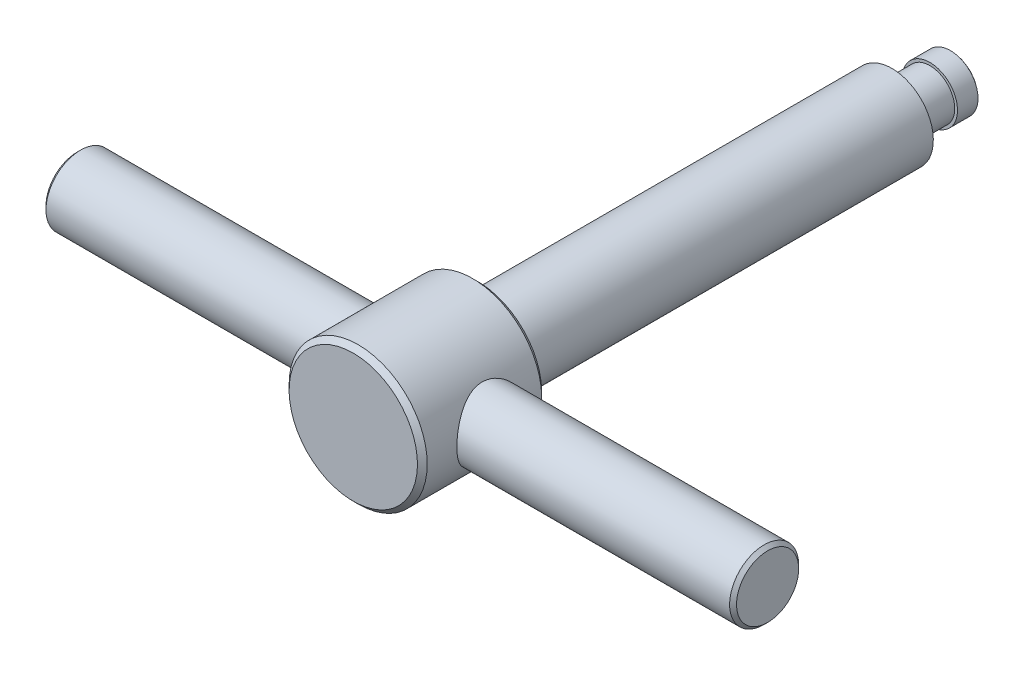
ISO-10303-21;
HEADER;
FILE_DESCRIPTION(('STEP AP214'),'2;1');
FILE_NAME('part.step','',(''),(''),'','','');
FILE_SCHEMA(('AUTOMOTIVE_DESIGN { 1 0 10303 214 1 1 1 1 }'));
ENDSEC;
DATA;
#1=APPLICATION_CONTEXT('core data for automotive mechanical design processes');
#2=APPLICATION_PROTOCOL_DEFINITION('international standard','automotive_design',2000,#1);
#3=PRODUCT_CONTEXT('',#1,'mechanical');
#4=PRODUCT('Part','Part','',(#3));
#5=PRODUCT_RELATED_PRODUCT_CATEGORY('part','',(#4));
#6=PRODUCT_DEFINITION_FORMATION('','',#4);
#7=PRODUCT_DEFINITION_CONTEXT('part definition',#1,'design');
#8=PRODUCT_DEFINITION('design','',#6,#7);
#9=PRODUCT_DEFINITION_SHAPE('','',#8);
#10=(LENGTH_UNIT() NAMED_UNIT(*) SI_UNIT(.MILLI.,.METRE.));
#11=(NAMED_UNIT(*) PLANE_ANGLE_UNIT() SI_UNIT($,.RADIAN.));
#12=(NAMED_UNIT(*) SI_UNIT($,.STERADIAN.) SOLID_ANGLE_UNIT());
#13=UNCERTAINTY_MEASURE_WITH_UNIT(LENGTH_MEASURE(1.E-05),#10,'distance_accuracy_value','');
#14=(GEOMETRIC_REPRESENTATION_CONTEXT(3) GLOBAL_UNCERTAINTY_ASSIGNED_CONTEXT((#13)) GLOBAL_UNIT_ASSIGNED_CONTEXT((#10,
#11,#12)) REPRESENTATION_CONTEXT('',''));
#15=CARTESIAN_POINT('',(0.,0.,0.));
#16=DIRECTION('',(0.,0.,1.));
#17=DIRECTION('',(1.,0.,0.));
#18=AXIS2_PLACEMENT_3D('',#15,#16,#17);
#19=CARTESIAN_POINT('',(50.,0.,82.5));
#20=DIRECTION('',(-1.,0.,0.));
#21=DIRECTION('',(0.,-1.,0.));
#22=AXIS2_PLACEMENT_3D('',#19,#20,#21);
#23=PLANE('',#22);
#24=CARTESIAN_POINT('',(50.0000000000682,0.,78.));
#25=DIRECTION('',(-1.,0.,0.));
#26=DIRECTION('',(0.,0.,-1.));
#27=AXIS2_PLACEMENT_3D('',#24,#25,#26);
#28=CIRCLE('',#27,4.49999999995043);
#29=CARTESIAN_POINT('',(50.0000000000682,0.,73.5000000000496));
#30=VERTEX_POINT('',#29);
#31=EDGE_CURVE('E15',#30,#30,#28,.T.);
#32=ORIENTED_EDGE('',*,*,#31,.F.);
#33=EDGE_LOOP('',(#32));
#34=FACE_BOUND('',#33,.T.);
#35=ADVANCED_FACE('F12',(#34),#23,.F.);
#36=CARTESIAN_POINT('',(-50.,0.,78.));
#37=DIRECTION('',(1.,0.,0.));
#38=DIRECTION('',(0.,1.,0.));
#39=AXIS2_PLACEMENT_3D('',#36,#37,#38);
#40=PLANE('',#39);
#41=CARTESIAN_POINT('',(-50.0000000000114,0.,78.));
#42=DIRECTION('',(1.,0.,0.));
#43=DIRECTION('',(0.,1.,0.));
#44=AXIS2_PLACEMENT_3D('',#41,#42,#43);
#45=CIRCLE('',#44,4.50000000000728);
#46=CARTESIAN_POINT('',(-50.0000000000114,4.50000000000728,78.));
#47=VERTEX_POINT('',#46);
#48=EDGE_CURVE('E133',#47,#47,#45,.T.);
#49=ORIENTED_EDGE('',*,*,#48,.F.);
#50=EDGE_LOOP('',(#49));
#51=FACE_BOUND('',#50,.T.);
#52=ADVANCED_FACE('F171',(#51),#40,.F.);
#53=CARTESIAN_POINT('',(0.,0.,6.));
#54=DIRECTION('',(-1.,0.,0.));
#55=DIRECTION('',(0.,1.,0.));
#56=AXIS2_PLACEMENT_3D('',#53,#54,#55);
#57=SPHERICAL_SURFACE('',#56,6.);
#58=CARTESIAN_POINT('',(0.,0.,1.52786404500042));
#59=DIRECTION('',(0.,0.,1.));
#60=DIRECTION('',(0.,-1.,0.));
#61=AXIS2_PLACEMENT_3D('',#58,#59,#60);
#62=CIRCLE('',#61,4.);
#63=CARTESIAN_POINT('',(0.,-4.,1.52786404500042));
#64=VERTEX_POINT('',#63);
#65=EDGE_CURVE('E126',#64,#64,#62,.T.);
#66=ORIENTED_EDGE('',*,*,#65,.F.);
#67=EDGE_LOOP('',(#66));
#68=FACE_BOUND('',#67,.T.);
#69=ADVANCED_FACE('F168',(#68),#57,.T.);
#70=CARTESIAN_POINT('',(49.5000000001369,0.,78.));
#71=DIRECTION('',(-1.,0.,0.));
#72=DIRECTION('',(0.,0.,-1.));
#73=AXIS2_PLACEMENT_3D('',#70,#71,#72);
#74=CONICAL_SURFACE('',#73,4.99999999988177,0.785398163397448);
#75=CARTESIAN_POINT('',(49.5,0.,78.));
#76=DIRECTION('',(-1.,0.,0.));
#77=DIRECTION('',(0.,-1.,0.));
#78=AXIS2_PLACEMENT_3D('',#75,#76,#77);
#79=CIRCLE('',#78,5.);
#80=CARTESIAN_POINT('',(49.5,-5.,78.));
#81=VERTEX_POINT('',#80);
#82=EDGE_CURVE('E124',#81,#81,#79,.T.);
#83=ORIENTED_EDGE('',*,*,#82,.F.);
#84=EDGE_LOOP('',(#83));
#85=FACE_BOUND('',#84,.T.);
#86=ORIENTED_EDGE('',*,*,#31,.T.);
#87=EDGE_LOOP('',(#86));
#88=FACE_BOUND('',#87,.T.);
#89=ADVANCED_FACE('F164',(#85,#88),#74,.T.);
#90=CARTESIAN_POINT('',(0.,0.,88.));
#91=DIRECTION('',(0.,0.,-1.));
#92=DIRECTION('',(0.,1.,0.));
#93=AXIS2_PLACEMENT_3D('',#90,#91,#92);
#94=PLANE('',#93);
#95=CARTESIAN_POINT('',(0.,0.,88.));
#96=DIRECTION('',(0.,0.,-1.));
#97=DIRECTION('',(0.,1.,0.));
#98=AXIS2_PLACEMENT_3D('',#95,#96,#97);
#99=CIRCLE('',#98,9.29289321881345);
#100=CARTESIAN_POINT('',(0.,9.29289321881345,88.));
#101=VERTEX_POINT('',#100);
#102=EDGE_CURVE('E121',#101,#101,#99,.T.);
#103=ORIENTED_EDGE('',*,*,#102,.F.);
#104=EDGE_LOOP('',(#103));
#105=FACE_BOUND('',#104,.T.);
#106=ADVANCED_FACE('F160',(#105),#94,.F.);
#107=CARTESIAN_POINT('',(-49.5000000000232,0.,78.));
#108=DIRECTION('',(1.,0.,0.));
#109=DIRECTION('',(0.,1.,0.));
#110=AXIS2_PLACEMENT_3D('',#107,#108,#109);
#111=CONICAL_SURFACE('',#110,4.99999999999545,0.785398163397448);
#112=ORIENTED_EDGE('',*,*,#48,.T.);
#113=EDGE_LOOP('',(#112));
#114=FACE_BOUND('',#113,.T.);
#115=CARTESIAN_POINT('',(-49.5,0.,78.));
#116=DIRECTION('',(-1.,0.,0.));
#117=DIRECTION('',(0.,-1.,0.));
#118=AXIS2_PLACEMENT_3D('',#115,#116,#117);
#119=CIRCLE('',#118,5.);
#120=CARTESIAN_POINT('',(-49.5,-5.,78.));
#121=VERTEX_POINT('',#120);
#122=EDGE_CURVE('E117',#121,#121,#119,.F.);
#123=ORIENTED_EDGE('',*,*,#122,.F.);
#124=EDGE_LOOP('',(#123));
#125=FACE_BOUND('',#124,.T.);
#126=ADVANCED_FACE('F154',(#114,#125),#111,.T.);
#127=CARTESIAN_POINT('',(0.,0.,0.));
#128=DIRECTION('',(0.,0.,1.));
#129=DIRECTION('',(0.,-1.,0.));
#130=AXIS2_PLACEMENT_3D('',#127,#128,#129);
#131=CYLINDRICAL_SURFACE('',#130,4.);
#132=CARTESIAN_POINT('',(0.,0.,4.5));
#133=DIRECTION('',(0.,0.,1.));
#134=DIRECTION('',(0.,-1.,0.));
#135=AXIS2_PLACEMENT_3D('',#132,#133,#134);
#136=CIRCLE('',#135,4.);
#137=CARTESIAN_POINT('',(0.,-4.,4.5));
#138=VERTEX_POINT('',#137);
#139=EDGE_CURVE('E120',#138,#138,#136,.F.);
#140=ORIENTED_EDGE('',*,*,#139,.T.);
#141=EDGE_LOOP('',(#140));
#142=FACE_BOUND('',#141,.T.);
#143=ORIENTED_EDGE('',*,*,#65,.T.);
#144=EDGE_LOOP('',(#143));
#145=FACE_BOUND('',#144,.T.);
#146=ADVANCED_FACE('F147',(#142,#145),#131,.T.);
#147=CARTESIAN_POINT('',(50.,0.,78.));
#148=DIRECTION('',(-1.,0.,0.));
#149=DIRECTION('',(0.,-1.,0.));
#150=AXIS2_PLACEMENT_3D('',#147,#148,#149);
#151=CYLINDRICAL_SURFACE('',#150,5.);
#152=CARTESIAN_POINT('',(8.6639413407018,4.99360795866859,77.7472559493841));
#153=CARTESIAN_POINT('',(8.6678034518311,4.98690821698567,77.6149033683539));
#154=CARTESIAN_POINT('',(8.67469455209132,4.97494418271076,77.4828866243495));
#155=CARTESIAN_POINT('',(8.69427133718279,4.94065080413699,77.2205887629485));
#156=CARTESIAN_POINT('',(8.70696013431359,4.91831589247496,77.0903086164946));
#157=CARTESIAN_POINT('',(8.73768503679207,4.86352211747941,76.8322782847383));
#158=CARTESIAN_POINT('',(8.75573112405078,4.83104434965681,76.7045333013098));
#159=CARTESIAN_POINT('',(8.79651985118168,4.75636852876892,76.4526662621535));
#160=CARTESIAN_POINT('',(8.81926458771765,4.71416613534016,76.3285458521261));
#161=CARTESIAN_POINT('',(8.89313906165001,4.57418822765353,75.964300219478));
#162=CARTESIAN_POINT('',(8.95014013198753,4.46265322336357,75.7304943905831));
#163=CARTESIAN_POINT('',(9.0733709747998,4.20643250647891,75.2848338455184));
#164=CARTESIAN_POINT('',(9.13960025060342,4.0617485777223,75.0729779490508));
#165=CARTESIAN_POINT('',(9.28089281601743,3.72835184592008,74.6568680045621));
#166=CARTESIAN_POINT('',(9.35622221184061,3.53689559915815,74.4548979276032));
#167=CARTESIAN_POINT('',(9.50269094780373,3.12203782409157,74.0846325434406));
#168=CARTESIAN_POINT('',(9.57382865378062,2.89862395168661,73.9163503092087));
#169=CARTESIAN_POINT('',(9.67330415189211,2.53843331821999,73.6898233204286));
#170=CARTESIAN_POINT('',(9.70581228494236,2.41146244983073,73.6174994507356));
#171=CARTESIAN_POINT('',(9.76685013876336,2.15092926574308,73.4839286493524));
#172=CARTESIAN_POINT('',(9.79538157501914,2.01736982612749,73.4226769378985));
#173=CARTESIAN_POINT('',(9.84761864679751,1.74461665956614,73.3119327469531));
#174=CARTESIAN_POINT('',(9.87132625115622,1.60542525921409,73.2624354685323));
#175=CARTESIAN_POINT('',(9.91320308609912,1.32244067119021,73.1757863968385));
#176=CARTESIAN_POINT('',(9.93137296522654,1.17864802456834,73.138633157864));
#177=CARTESIAN_POINT('',(9.96027993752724,0.900367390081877,73.0798607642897));
#178=CARTESIAN_POINT('',(9.97152591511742,0.766157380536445,73.0571718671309));
#179=CARTESIAN_POINT('',(9.98860845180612,0.495997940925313,73.022799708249));
#180=CARTESIAN_POINT('',(9.99444546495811,0.360048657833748,73.0111155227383));
#181=CARTESIAN_POINT('',(10.0005447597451,0.087573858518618,72.9989077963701));
#182=CARTESIAN_POINT('',(10.0008090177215,-0.04895143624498,72.9983802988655));
#183=CARTESIAN_POINT('',(9.99576016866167,-0.321481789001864,73.0084830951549));
#184=CARTESIAN_POINT('',(9.99044726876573,-0.457486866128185,73.0191129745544));
#185=CARTESIAN_POINT('',(9.97498362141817,-0.717956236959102,73.0502056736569));
#186=CARTESIAN_POINT('',(9.96521520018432,-0.842536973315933,73.0698923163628));
#187=CARTESIAN_POINT('',(9.94124846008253,-1.08948387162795,73.1185178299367));
#188=CARTESIAN_POINT('',(9.92704873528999,-1.21184931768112,73.1474596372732));
#189=CARTESIAN_POINT('',(9.89455126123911,-1.45351624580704,73.2142922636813));
#190=CARTESIAN_POINT('',(9.87625470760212,-1.57281861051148,73.2521804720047));
#191=CARTESIAN_POINT('',(9.83597398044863,-1.80771983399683,73.3365518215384));
#192=CARTESIAN_POINT('',(9.81398839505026,-1.92331725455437,73.3830382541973));
#193=CARTESIAN_POINT('',(9.74156802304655,-2.27136199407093,73.5382972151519));
#194=CARTESIAN_POINT('',(9.68581324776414,-2.49684688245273,73.6605947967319));
#195=CARTESIAN_POINT('',(9.56530778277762,-2.92480777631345,73.9366877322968));
#196=CARTESIAN_POINT('',(9.50055298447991,-3.12727319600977,74.0904974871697));
#197=CARTESIAN_POINT('',(9.36078921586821,-3.52480596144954,74.4428786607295));
#198=CARTESIAN_POINT('',(9.2854000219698,-3.71715140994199,74.6443755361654));
#199=CARTESIAN_POINT('',(9.1378260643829,-4.06646861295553,75.0774671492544));
#200=CARTESIAN_POINT('',(9.06564336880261,-4.22341779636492,75.3090809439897));
#201=CARTESIAN_POINT('',(8.96466251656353,-4.4318323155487,75.68047576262));
#202=CARTESIAN_POINT('',(8.93163700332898,-4.49782747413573,75.8111425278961));
#203=CARTESIAN_POINT('',(8.86988749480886,-4.618406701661,76.0785929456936));
#204=CARTESIAN_POINT('',(8.84116149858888,-4.67299608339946,76.2153737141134));
#205=CARTESIAN_POINT('',(8.78915478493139,-4.77009386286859,76.4940256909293));
#206=CARTESIAN_POINT('',(8.76586925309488,-4.81261294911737,76.6358922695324));
#207=CARTESIAN_POINT('',(8.72571734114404,-4.88503616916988,76.9236976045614));
#208=CARTESIAN_POINT('',(8.7088499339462,-4.91494232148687,77.0696357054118));
#209=CARTESIAN_POINT('',(8.68367597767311,-4.95926907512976,77.3491683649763));
#210=CARTESIAN_POINT('',(8.67467052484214,-4.9749602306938,77.4824995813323));
#211=CARTESIAN_POINT('',(8.66282228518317,-4.99556348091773,77.7502606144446));
#212=CARTESIAN_POINT('',(8.65997890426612,-5.00047661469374,77.88469032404));
#213=CARTESIAN_POINT('',(8.66057117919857,-4.99945062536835,78.1534566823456));
#214=CARTESIAN_POINT('',(8.66400516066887,-4.99351439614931,78.2877933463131));
#215=CARTESIAN_POINT('',(8.67700761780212,-4.97088602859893,78.5552512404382));
#216=CARTESIAN_POINT('',(8.68657590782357,-4.95419421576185,78.6883725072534));
#217=CARTESIAN_POINT('',(8.71036385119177,-4.91223841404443,78.940629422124));
#218=CARTESIAN_POINT('',(8.72409695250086,-4.88786373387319,79.0599602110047));
#219=CARTESIAN_POINT('',(8.75590671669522,-4.83064807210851,79.2959957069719));
#220=CARTESIAN_POINT('',(8.77398472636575,-4.79780446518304,79.4126995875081));
#221=CARTESIAN_POINT('',(8.83395755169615,-4.68703534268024,79.7578390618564));
#222=CARTESIAN_POINT('',(8.88160721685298,-4.59684472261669,79.9814608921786));
#223=CARTESIAN_POINT('',(8.99125967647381,-4.3787162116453,80.4275802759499));
#224=CARTESIAN_POINT('',(9.05407323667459,-4.2484468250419,80.6487244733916));
#225=CARTESIAN_POINT('',(9.18532801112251,-3.95668828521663,81.0675468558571));
#226=CARTESIAN_POINT('',(9.25377257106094,-3.79518049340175,81.265210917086));
#227=CARTESIAN_POINT('',(9.39832077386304,-3.42284387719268,81.6558446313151));
#228=CARTESIAN_POINT('',(9.47436862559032,-3.20843552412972,81.8454686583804));
#229=CARTESIAN_POINT('',(9.58193181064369,-2.8637698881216,82.1011420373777));
#230=CARTESIAN_POINT('',(9.61672131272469,-2.744956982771,82.1816143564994));
#231=CARTESIAN_POINT('',(9.68322432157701,-2.50024068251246,82.3323683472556));
#232=CARTESIAN_POINT('',(9.71493926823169,-2.37434065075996,82.402654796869));
#233=CARTESIAN_POINT('',(9.77437128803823,-2.11640250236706,82.5322892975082));
#234=CARTESIAN_POINT('',(9.80209494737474,-1.98437498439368,82.5916554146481));
#235=CARTESIAN_POINT('',(9.85280649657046,-1.71492890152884,82.698939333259));
#236=CARTESIAN_POINT('',(9.87579659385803,-1.57751288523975,82.7468624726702));
#237=CARTESIAN_POINT('',(9.91635831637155,-1.2983529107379,82.8306839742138));
#238=CARTESIAN_POINT('',(9.93393271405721,-1.15661120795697,82.8665884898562));
#239=CARTESIAN_POINT('',(9.96312961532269,-0.869940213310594,82.9259131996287));
#240=CARTESIAN_POINT('',(9.97475279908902,-0.725011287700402,82.949334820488));
#241=CARTESIAN_POINT('',(9.99083813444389,-0.447757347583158,82.9816683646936));
#242=CARTESIAN_POINT('',(9.99589570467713,-0.315606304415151,82.9917879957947));
#243=CARTESIAN_POINT('',(10.0007472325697,-0.0508240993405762,83.0014961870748));
#244=CARTESIAN_POINT('',(10.000541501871,0.0818070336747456,83.0010853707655));
#245=CARTESIAN_POINT('',(9.9948722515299,0.346478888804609,82.9897389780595));
#246=CARTESIAN_POINT('',(9.98940968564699,0.478519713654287,82.9788053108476));
#247=CARTESIAN_POINT('',(9.9733744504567,0.741008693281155,82.9465536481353));
#248=CARTESIAN_POINT('',(9.96280181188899,0.871456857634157,82.9252357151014));
#249=CARTESIAN_POINT('',(9.93743452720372,1.12369515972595,82.8737135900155));
#250=CARTESIAN_POINT('',(9.92286271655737,1.24560333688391,82.8439763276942));
#251=CARTESIAN_POINT('',(9.88966974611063,1.48634787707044,82.775610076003));
#252=CARTESIAN_POINT('',(9.87104728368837,1.60518323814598,82.7369782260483));
#253=CARTESIAN_POINT('',(9.80970869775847,1.95595951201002,82.6082690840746));
#254=CARTESIAN_POINT('',(9.76150048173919,2.1823686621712,82.5053371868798));
#255=CARTESIAN_POINT('',(9.65124513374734,2.62860908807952,82.2613458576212));
#256=CARTESIAN_POINT('',(9.58853528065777,2.84720551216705,82.1183503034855));
#257=CARTESIAN_POINT('',(9.45668808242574,3.25848585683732,81.8012792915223));
#258=CARTESIAN_POINT('',(9.38754708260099,3.45115488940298,81.6271861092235));
#259=CARTESIAN_POINT('',(9.24208671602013,3.82463320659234,81.2331021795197));
#260=CARTESIAN_POINT('',(9.16572457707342,4.00245580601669,81.0102916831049));
#261=CARTESIAN_POINT('',(9.02097056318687,4.31884937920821,80.5355067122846));
#262=CARTESIAN_POINT('',(8.95258327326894,4.4573978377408,80.2835156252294));
#263=CARTESIAN_POINT('',(8.86265475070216,4.63224192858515,79.8876796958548));
#264=CARTESIAN_POINT('',(8.83473366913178,4.68511709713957,79.752400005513));
#265=CARTESIAN_POINT('',(8.78424027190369,4.77911859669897,79.4768789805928));
#266=CARTESIAN_POINT('',(8.76166504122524,4.82025133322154,79.3366403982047));
#267=CARTESIAN_POINT('',(8.72286222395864,4.89011973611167,79.0526469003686));
#268=CARTESIAN_POINT('',(8.70661815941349,4.91888760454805,78.9089021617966));
#269=CARTESIAN_POINT('',(8.68114164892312,4.96371371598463,78.6189038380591));
#270=CARTESIAN_POINT('',(8.67190422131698,4.97978098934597,78.4726521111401));
#271=CARTESIAN_POINT('',(8.66276238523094,4.99565691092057,78.2296234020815));
#272=CARTESIAN_POINT('',(8.66073972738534,4.99915860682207,78.1331479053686));
#273=CARTESIAN_POINT('',(8.65992340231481,5.00057282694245,77.9401409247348));
#274=CARTESIAN_POINT('',(8.66112970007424,4.99848541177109,77.8436094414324));
#275=CARTESIAN_POINT('',(8.6639413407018,4.99360795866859,77.7472559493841));
#276=B_SPLINE_CURVE_WITH_KNOTS('',3,(#152,#153,#154,#155,#156,#157,#158,#159,#160,#161,#162,
#163,#164,#165,#166,#167,#168,#169,#170,#171,#172,#173,#174,#175,#176,#177,#178,#179,#180,#181,
#182,#183,#184,#185,#186,#187,#188,#189,#190,#191,#192,#193,#194,#195,#196,#197,#198,#199,#200,
#201,#202,#203,#204,#205,#206,#207,#208,#209,#210,#211,#212,#213,#214,#215,#216,#217,#218,#219,
#220,#221,#222,#223,#224,#225,#226,#227,#228,#229,#230,#231,#232,#233,#234,#235,#236,#237,#238,
#239,#240,#241,#242,#243,#244,#245,#246,#247,#248,#249,#250,#251,#252,#253,#254,#255,#256,#257,
#258,#259,#260,#261,#262,#263,#264,#265,#266,#267,#268,#269,#270,#271,#272,#273,#274,#275),
.UNSPECIFIED.,.T.,.F.,(4,2,2,2,2,2,2,2,2,2,2,2,2,2,2,2,2,2,2,2,2,2,2,2,2,2,2,2,2,2,2,2,2,2,2,2,
2,2,2,2,2,2,2,2,2,2,2,2,2,2,2,2,2,2,2,2,2,2,2,2,2,4),(0.,0.397631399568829,0.795476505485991,
1.19406759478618,1.59283693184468,2.3848881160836,3.17689668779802,4.03814904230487,
4.89973497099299,5.34831866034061,5.7967082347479,6.24491443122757,6.69306811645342,
7.10225762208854,7.51141277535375,7.92042282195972,8.32941767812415,8.70849392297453,
9.0876905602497,9.46677667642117,9.84600821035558,10.6299816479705,11.4143141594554,
12.2763801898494,13.1389943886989,13.5886788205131,14.0381533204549,14.4872285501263,
14.9362318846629,15.3393329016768,15.7423950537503,16.1453497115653,16.5482921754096,
16.9155764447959,17.2829747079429,18.0172923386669,18.806919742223,19.5970197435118,
20.4809562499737,20.9234827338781,21.3658009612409,21.8073807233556,22.2487540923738,
22.6899011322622,23.1309977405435,23.5283898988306,23.9257585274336,24.3230550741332,
24.7203492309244,25.0988909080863,25.4775544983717,26.2342787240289,27.0369665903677,
27.8401134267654,28.7215475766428,29.6034860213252,30.0466691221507,30.4896100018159,
30.9313902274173,31.3728560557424,31.6623372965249,31.9518153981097),.UNSPECIFIED.);
#277=CARTESIAN_POINT('',(8.6639413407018,4.99360795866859,77.7472559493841));
#278=VERTEX_POINT('',#277);
#279=EDGE_CURVE('E46',#278,#278,#276,.T.);
#280=ORIENTED_EDGE('',*,*,#279,.F.);
#281=EDGE_LOOP('',(#280));
#282=FACE_BOUND('',#281,.T.);
#283=ORIENTED_EDGE('',*,*,#82,.T.);
#284=EDGE_LOOP('',(#283));
#285=FACE_BOUND('',#284,.T.);
#286=ADVANCED_FACE('F145',(#282,#285),#151,.T.);
#287=CARTESIAN_POINT('',(0.,0.,87.2928932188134));
#288=DIRECTION('',(0.,0.,-1.));
#289=DIRECTION('',(0.,1.,0.));
#290=AXIS2_PLACEMENT_3D('',#287,#288,#289);
#291=CONICAL_SURFACE('',#290,10.,0.78539816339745);
#292=ORIENTED_EDGE('',*,*,#102,.T.);
#293=EDGE_LOOP('',(#292));
#294=FACE_BOUND('',#293,.T.);
#295=CARTESIAN_POINT('',(0.,0.,87.2928932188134));
#296=DIRECTION('',(0.,0.,1.));
#297=DIRECTION('',(0.,-1.,0.));
#298=AXIS2_PLACEMENT_3D('',#295,#296,#297);
#299=CIRCLE('',#298,10.);
#300=CARTESIAN_POINT('',(0.,-10.,87.2928932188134));
#301=VERTEX_POINT('',#300);
#302=EDGE_CURVE('E45',#301,#301,#299,.F.);
#303=ORIENTED_EDGE('',*,*,#302,.F.);
#304=EDGE_LOOP('',(#303));
#305=FACE_BOUND('',#304,.T.);
#306=ADVANCED_FACE('F72',(#294,#305),#291,.T.);
#307=CARTESIAN_POINT('',(50.,0.,78.));
#308=DIRECTION('',(-1.,0.,0.));
#309=DIRECTION('',(0.,-1.,0.));
#310=AXIS2_PLACEMENT_3D('',#307,#308,#309);
#311=CYLINDRICAL_SURFACE('',#310,5.);
#312=ORIENTED_EDGE('',*,*,#122,.T.);
#313=EDGE_LOOP('',(#312));
#314=FACE_BOUND('',#313,.T.);
#315=CARTESIAN_POINT('',(-8.6639413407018,4.99360795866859,78.2527440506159));
#316=CARTESIAN_POINT('',(-8.6678034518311,4.98690821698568,78.3850966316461));
#317=CARTESIAN_POINT('',(-8.67469455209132,4.97494418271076,78.5171133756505));
#318=CARTESIAN_POINT('',(-8.69427133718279,4.94065080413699,78.7794112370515));
#319=CARTESIAN_POINT('',(-8.70696013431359,4.91831589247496,78.9096913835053));
#320=CARTESIAN_POINT('',(-8.73768503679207,4.86352211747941,79.1677217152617));
#321=CARTESIAN_POINT('',(-8.75573112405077,4.83104434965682,79.2954666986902));
#322=CARTESIAN_POINT('',(-8.79651985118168,4.75636852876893,79.5473337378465));
#323=CARTESIAN_POINT('',(-8.81926458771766,4.71416613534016,79.6714541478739));
#324=CARTESIAN_POINT('',(-8.89313906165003,4.57418822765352,80.035699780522));
#325=CARTESIAN_POINT('',(-8.95014013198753,4.46265322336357,80.2695056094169));
#326=CARTESIAN_POINT('',(-9.0733709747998,4.20643250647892,80.7151661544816));
#327=CARTESIAN_POINT('',(-9.13960025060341,4.06174857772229,80.9270220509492));
#328=CARTESIAN_POINT('',(-9.28089281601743,3.72835184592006,81.3431319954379));
#329=CARTESIAN_POINT('',(-9.35622221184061,3.53689559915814,81.5451020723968));
#330=CARTESIAN_POINT('',(-9.50269094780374,3.12203782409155,81.9153674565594));
#331=CARTESIAN_POINT('',(-9.57382865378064,2.89862395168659,82.0836496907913));
#332=CARTESIAN_POINT('',(-9.67330415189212,2.53843331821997,82.3101766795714));
#333=CARTESIAN_POINT('',(-9.70581228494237,2.41146244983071,82.3825005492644));
#334=CARTESIAN_POINT('',(-9.76685013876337,2.15092926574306,82.5160713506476));
#335=CARTESIAN_POINT('',(-9.79538157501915,2.01736982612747,82.5773230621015));
#336=CARTESIAN_POINT('',(-9.84761864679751,1.74461665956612,82.6880672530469));
#337=CARTESIAN_POINT('',(-9.87132625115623,1.60542525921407,82.7375645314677));
#338=CARTESIAN_POINT('',(-9.91320308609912,1.32244067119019,82.8242136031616));
#339=CARTESIAN_POINT('',(-9.93137296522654,1.17864802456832,82.861366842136));
#340=CARTESIAN_POINT('',(-9.96027993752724,0.900367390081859,82.9201392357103));
#341=CARTESIAN_POINT('',(-9.97152591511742,0.766157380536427,82.9428281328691));
#342=CARTESIAN_POINT('',(-9.98860845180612,0.495997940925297,82.977200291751));
#343=CARTESIAN_POINT('',(-9.99444546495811,0.360048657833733,82.9888844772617));
#344=CARTESIAN_POINT('',(-10.0005447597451,0.0875738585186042,83.0010922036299));
#345=CARTESIAN_POINT('',(-10.0008090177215,-0.0489514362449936,83.0016197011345));
#346=CARTESIAN_POINT('',(-9.99576016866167,-0.321481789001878,82.9915169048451));
#347=CARTESIAN_POINT('',(-9.99044726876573,-0.457486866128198,82.9808870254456));
#348=CARTESIAN_POINT('',(-9.97498362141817,-0.717956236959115,82.9497943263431));
#349=CARTESIAN_POINT('',(-9.96521520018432,-0.842536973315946,82.9301076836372));
#350=CARTESIAN_POINT('',(-9.94124846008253,-1.08948387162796,82.8814821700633));
#351=CARTESIAN_POINT('',(-9.92704873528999,-1.21184931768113,82.8525403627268));
#352=CARTESIAN_POINT('',(-9.89455126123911,-1.45351624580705,82.7857077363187));
#353=CARTESIAN_POINT('',(-9.87625470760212,-1.57281861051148,82.7478195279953));
#354=CARTESIAN_POINT('',(-9.83597398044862,-1.80771983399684,82.6634481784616));
#355=CARTESIAN_POINT('',(-9.81398839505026,-1.92331725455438,82.6169617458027));
#356=CARTESIAN_POINT('',(-9.74156802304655,-2.27136199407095,82.4617027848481));
#357=CARTESIAN_POINT('',(-9.68581324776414,-2.49684688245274,82.3394052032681));
#358=CARTESIAN_POINT('',(-9.56530778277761,-2.92480777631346,82.0633122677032));
#359=CARTESIAN_POINT('',(-9.5005529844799,-3.12727319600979,81.9095025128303));
#360=CARTESIAN_POINT('',(-9.3607892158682,-3.52480596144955,81.5571213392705));
#361=CARTESIAN_POINT('',(-9.2854000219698,-3.717151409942,81.3556244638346));
#362=CARTESIAN_POINT('',(-9.1378260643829,-4.06646861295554,80.9225328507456));
#363=CARTESIAN_POINT('',(-9.06564336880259,-4.22341779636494,80.6909190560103));
#364=CARTESIAN_POINT('',(-8.96466251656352,-4.43183231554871,80.31952423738));
#365=CARTESIAN_POINT('',(-8.93163700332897,-4.49782747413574,80.1888574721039));
#366=CARTESIAN_POINT('',(-8.86988749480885,-4.61840670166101,79.9214070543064));
#367=CARTESIAN_POINT('',(-8.84116149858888,-4.67299608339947,79.7846262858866));
#368=CARTESIAN_POINT('',(-8.78915478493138,-4.77009386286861,79.5059743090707));
#369=CARTESIAN_POINT('',(-8.76586925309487,-4.81261294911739,79.3641077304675));
#370=CARTESIAN_POINT('',(-8.72571734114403,-4.88503616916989,79.0763023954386));
#371=CARTESIAN_POINT('',(-8.70884993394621,-4.91494232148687,78.9303642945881));
#372=CARTESIAN_POINT('',(-8.68367597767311,-4.95926907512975,78.6508316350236));
#373=CARTESIAN_POINT('',(-8.67467052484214,-4.9749602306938,78.5175004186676));
#374=CARTESIAN_POINT('',(-8.66282228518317,-4.99556348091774,78.2497393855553));
#375=CARTESIAN_POINT('',(-8.65997890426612,-5.00047661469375,78.1153096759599));
#376=CARTESIAN_POINT('',(-8.66057117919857,-4.99945062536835,77.8465433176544));
#377=CARTESIAN_POINT('',(-8.66400516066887,-4.99351439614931,77.7122066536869));
#378=CARTESIAN_POINT('',(-8.67700761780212,-4.97088602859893,77.4447487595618));
#379=CARTESIAN_POINT('',(-8.68657590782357,-4.95419421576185,77.3116274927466));
#380=CARTESIAN_POINT('',(-8.71036385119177,-4.91223841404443,77.059370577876));
#381=CARTESIAN_POINT('',(-8.72409695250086,-4.88786373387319,76.9400397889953));
#382=CARTESIAN_POINT('',(-8.75590671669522,-4.83064807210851,76.7040042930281));
#383=CARTESIAN_POINT('',(-8.77398472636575,-4.79780446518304,76.5873004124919));
#384=CARTESIAN_POINT('',(-8.83395755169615,-4.68703534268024,76.2421609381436));
#385=CARTESIAN_POINT('',(-8.88160721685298,-4.59684472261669,76.0185391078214));
#386=CARTESIAN_POINT('',(-8.99125967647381,-4.3787162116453,75.5724197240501));
#387=CARTESIAN_POINT('',(-9.05407323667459,-4.2484468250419,75.3512755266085));
#388=CARTESIAN_POINT('',(-9.18532801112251,-3.95668828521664,74.9324531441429));
#389=CARTESIAN_POINT('',(-9.25377257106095,-3.79518049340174,74.734789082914));
#390=CARTESIAN_POINT('',(-9.39832077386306,-3.42284387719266,74.3441553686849));
#391=CARTESIAN_POINT('',(-9.47436862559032,-3.20843552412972,74.1545313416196));
#392=CARTESIAN_POINT('',(-9.58193181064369,-2.86376988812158,73.8988579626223));
#393=CARTESIAN_POINT('',(-9.61672131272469,-2.74495698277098,73.8183856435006));
#394=CARTESIAN_POINT('',(-9.68322432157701,-2.50024068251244,73.6676316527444));
#395=CARTESIAN_POINT('',(-9.7149392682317,-2.37434065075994,73.597345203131));
#396=CARTESIAN_POINT('',(-9.77437128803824,-2.11640250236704,73.4677107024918));
#397=CARTESIAN_POINT('',(-9.80209494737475,-1.98437498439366,73.4083445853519));
#398=CARTESIAN_POINT('',(-9.85280649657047,-1.71492890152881,73.301060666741));
#399=CARTESIAN_POINT('',(-9.87579659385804,-1.57751288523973,73.2531375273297));
#400=CARTESIAN_POINT('',(-9.91635831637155,-1.29835291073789,73.1693160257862));
#401=CARTESIAN_POINT('',(-9.93393271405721,-1.15661120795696,73.1334115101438));
#402=CARTESIAN_POINT('',(-9.9631296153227,-0.869940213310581,73.0740868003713));
#403=CARTESIAN_POINT('',(-9.97475279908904,-0.725011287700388,73.050665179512));
#404=CARTESIAN_POINT('',(-9.9908381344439,-0.447757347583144,73.0183316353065));
#405=CARTESIAN_POINT('',(-9.99589570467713,-0.315606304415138,73.0082120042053));
#406=CARTESIAN_POINT('',(-10.0007472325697,-0.0508240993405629,72.9985038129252));
#407=CARTESIAN_POINT('',(-10.000541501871,0.0818070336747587,72.9989146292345));
#408=CARTESIAN_POINT('',(-9.9948722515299,0.346478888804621,73.0102610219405));
#409=CARTESIAN_POINT('',(-9.98940968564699,0.478519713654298,73.0211946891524));
#410=CARTESIAN_POINT('',(-9.9733744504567,0.741008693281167,73.0534463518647));
#411=CARTESIAN_POINT('',(-9.96280181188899,0.871456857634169,73.0747642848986));
#412=CARTESIAN_POINT('',(-9.93743452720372,1.12369515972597,73.1262864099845));
#413=CARTESIAN_POINT('',(-9.92286271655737,1.24560333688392,73.1560236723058));
#414=CARTESIAN_POINT('',(-9.88966974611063,1.48634787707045,73.224389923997));
#415=CARTESIAN_POINT('',(-9.87104728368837,1.60518323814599,73.2630217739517));
#416=CARTESIAN_POINT('',(-9.80970869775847,1.95595951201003,73.3917309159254));
#417=CARTESIAN_POINT('',(-9.76150048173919,2.18236866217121,73.4946628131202));
#418=CARTESIAN_POINT('',(-9.65124513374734,2.62860908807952,73.7386541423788));
#419=CARTESIAN_POINT('',(-9.58853528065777,2.84720551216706,73.8816496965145));
#420=CARTESIAN_POINT('',(-9.45668808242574,3.25848585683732,74.1987207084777));
#421=CARTESIAN_POINT('',(-9.38754708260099,3.45115488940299,74.3728138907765));
#422=CARTESIAN_POINT('',(-9.24208671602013,3.82463320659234,74.7668978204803));
#423=CARTESIAN_POINT('',(-9.16572457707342,4.00245580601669,74.9897083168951));
#424=CARTESIAN_POINT('',(-9.02097056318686,4.31884937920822,75.4644932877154));
#425=CARTESIAN_POINT('',(-8.95258327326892,4.45739783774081,75.7164843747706));
#426=CARTESIAN_POINT('',(-8.86265475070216,4.63224192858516,76.1123203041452));
#427=CARTESIAN_POINT('',(-8.83473366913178,4.68511709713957,76.2475999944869));
#428=CARTESIAN_POINT('',(-8.78424027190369,4.77911859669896,76.5231210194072));
#429=CARTESIAN_POINT('',(-8.76166504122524,4.82025133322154,76.6633596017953));
#430=CARTESIAN_POINT('',(-8.72286222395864,4.89011973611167,76.9473530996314));
#431=CARTESIAN_POINT('',(-8.7066181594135,4.91888760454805,77.0910978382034));
#432=CARTESIAN_POINT('',(-8.68114164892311,4.96371371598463,77.3810961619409));
#433=CARTESIAN_POINT('',(-8.67190422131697,4.97978098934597,77.5273478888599));
#434=CARTESIAN_POINT('',(-8.66276238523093,4.99565691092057,77.7703765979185));
#435=CARTESIAN_POINT('',(-8.66073972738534,4.99915860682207,77.8668520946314));
#436=CARTESIAN_POINT('',(-8.65992340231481,5.00057282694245,78.0598590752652));
#437=CARTESIAN_POINT('',(-8.66112970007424,4.99848541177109,78.1563905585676));
#438=CARTESIAN_POINT('',(-8.6639413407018,4.99360795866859,78.2527440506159));
#439=B_SPLINE_CURVE_WITH_KNOTS('',3,(#315,#316,#317,#318,#319,#320,#321,#322,#323,#324,#325,
#326,#327,#328,#329,#330,#331,#332,#333,#334,#335,#336,#337,#338,#339,#340,#341,#342,#343,#344,
#345,#346,#347,#348,#349,#350,#351,#352,#353,#354,#355,#356,#357,#358,#359,#360,#361,#362,#363,
#364,#365,#366,#367,#368,#369,#370,#371,#372,#373,#374,#375,#376,#377,#378,#379,#380,#381,#382,
#383,#384,#385,#386,#387,#388,#389,#390,#391,#392,#393,#394,#395,#396,#397,#398,#399,#400,#401,
#402,#403,#404,#405,#406,#407,#408,#409,#410,#411,#412,#413,#414,#415,#416,#417,#418,#419,#420,
#421,#422,#423,#424,#425,#426,#427,#428,#429,#430,#431,#432,#433,#434,#435,#436,#437,#438),
.UNSPECIFIED.,.T.,.F.,(4,2,2,2,2,2,2,2,2,2,2,2,2,2,2,2,2,2,2,2,2,2,2,2,2,2,2,2,2,2,2,2,2,2,2,2,
2,2,2,2,2,2,2,2,2,2,2,2,2,2,2,2,2,2,2,2,2,2,2,2,2,4),(0.,0.397631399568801,0.795476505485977,
1.19406759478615,1.59283693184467,2.38488811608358,3.17689668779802,4.03814904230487,
4.899734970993,5.34831866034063,5.79670823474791,6.24491443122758,6.69306811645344,
7.10225762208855,7.51141277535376,7.92042282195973,8.32941767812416,8.70849392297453,
9.0876905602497,9.46677667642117,9.84600821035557,10.6299816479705,11.4143141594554,
12.2763801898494,13.1389943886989,13.5886788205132,14.0381533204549,14.4872285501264,
14.936231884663,15.3393329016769,15.7423950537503,16.1453497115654,16.5482921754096,
16.9155764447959,17.2829747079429,18.0172923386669,18.806919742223,19.5970197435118,
20.4809562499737,20.9234827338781,21.3658009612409,21.8073807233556,22.2487540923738,
22.6899011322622,23.1309977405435,23.5283898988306,23.9257585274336,24.3230550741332,
24.7203492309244,25.0988909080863,25.4775544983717,26.2342787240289,27.0369665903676,
27.8401134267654,28.7215475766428,29.6034860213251,30.0466691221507,30.4896100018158,
30.9313902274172,31.3728560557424,31.6623372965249,31.9518153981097),.UNSPECIFIED.);
#440=CARTESIAN_POINT('',(-8.6639413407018,4.99360795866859,78.2527440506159));
#441=VERTEX_POINT('',#440);
#442=EDGE_CURVE('E37',#441,#441,#439,.T.);
#443=ORIENTED_EDGE('',*,*,#442,.F.);
#444=EDGE_LOOP('',(#443));
#445=FACE_BOUND('',#444,.T.);
#446=ADVANCED_FACE('F52',(#314,#445),#311,.T.);
#447=CARTESIAN_POINT('',(3.6,0.,4.5));
#448=DIRECTION('',(0.,0.,-1.));
#449=DIRECTION('',(0.,1.,0.));
#450=AXIS2_PLACEMENT_3D('',#447,#448,#449);
#451=PLANE('',#450);
#452=CARTESIAN_POINT('',(0.,0.,4.5));
#453=DIRECTION('',(0.,0.,1.));
#454=DIRECTION('',(0.,-1.,0.));
#455=AXIS2_PLACEMENT_3D('',#452,#453,#454);
#456=CIRCLE('',#455,3.6);
#457=CARTESIAN_POINT('',(0.,-3.6,4.5));
#458=VERTEX_POINT('',#457);
#459=EDGE_CURVE('E33',#458,#458,#456,.T.);
#460=ORIENTED_EDGE('',*,*,#459,.F.);
#461=EDGE_LOOP('',(#460));
#462=FACE_BOUND('',#461,.T.);
#463=ORIENTED_EDGE('',*,*,#139,.F.);
#464=EDGE_LOOP('',(#463));
#465=FACE_BOUND('',#464,.T.);
#466=ADVANCED_FACE('F61',(#462,#465),#451,.F.);
#467=CARTESIAN_POINT('',(0.,0.,0.));
#468=DIRECTION('',(0.,0.,1.));
#469=DIRECTION('',(0.,-1.,0.));
#470=AXIS2_PLACEMENT_3D('',#467,#468,#469);
#471=CYLINDRICAL_SURFACE('',#470,10.);
#472=ORIENTED_EDGE('',*,*,#442,.T.);
#473=EDGE_LOOP('',(#472));
#474=FACE_BOUND('',#473,.T.);
#475=ORIENTED_EDGE('',*,*,#302,.T.);
#476=EDGE_LOOP('',(#475));
#477=FACE_BOUND('',#476,.T.);
#478=ORIENTED_EDGE('',*,*,#279,.T.);
#479=EDGE_LOOP('',(#478));
#480=FACE_BOUND('',#479,.T.);
#481=CARTESIAN_POINT('',(0.,0.,70.7071067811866));
#482=DIRECTION('',(0.,0.,1.));
#483=DIRECTION('',(0.,-1.,0.));
#484=AXIS2_PLACEMENT_3D('',#481,#482,#483);
#485=CIRCLE('',#484,10.);
#486=CARTESIAN_POINT('',(0.,-10.,70.7071067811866));
#487=VERTEX_POINT('',#486);
#488=EDGE_CURVE('E36',#487,#487,#485,.F.);
#489=ORIENTED_EDGE('',*,*,#488,.F.);
#490=EDGE_LOOP('',(#489));
#491=FACE_BOUND('',#490,.T.);
#492=ADVANCED_FACE('F56',(#474,#477,#480,#491),#471,.T.);
#493=CARTESIAN_POINT('',(0.,0.,0.));
#494=DIRECTION('',(0.,0.,1.));
#495=DIRECTION('',(0.,-1.,0.));
#496=AXIS2_PLACEMENT_3D('',#493,#494,#495);
#497=CYLINDRICAL_SURFACE('',#496,3.6);
#498=CARTESIAN_POINT('',(0.,0.,8.61435935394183));
#499=DIRECTION('',(0.,0.,1.));
#500=DIRECTION('',(0.,-1.,0.));
#501=AXIS2_PLACEMENT_3D('',#498,#499,#500);
#502=CIRCLE('',#501,3.59999999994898);
#503=CARTESIAN_POINT('',(0.,-3.59999999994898,8.61435935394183));
#504=VERTEX_POINT('',#503);
#505=EDGE_CURVE('E32',#504,#504,#502,.T.);
#506=ORIENTED_EDGE('',*,*,#505,.F.);
#507=EDGE_LOOP('',(#506));
#508=FACE_BOUND('',#507,.T.);
#509=ORIENTED_EDGE('',*,*,#459,.T.);
#510=EDGE_LOOP('',(#509));
#511=FACE_BOUND('',#510,.T.);
#512=ADVANCED_FACE('F60',(#508,#511),#497,.T.);
#513=CARTESIAN_POINT('',(0.,0.,70.7071067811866));
#514=DIRECTION('',(0.,0.,1.));
#515=DIRECTION('',(0.,-1.,0.));
#516=AXIS2_PLACEMENT_3D('',#513,#514,#515);
#517=CONICAL_SURFACE('',#516,10.,0.78539816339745);
#518=ORIENTED_EDGE('',*,*,#488,.T.);
#519=EDGE_LOOP('',(#518));
#520=FACE_BOUND('',#519,.T.);
#521=CARTESIAN_POINT('',(0.,0.,70.));
#522=DIRECTION('',(0.,0.,1.));
#523=DIRECTION('',(0.,-1.,0.));
#524=AXIS2_PLACEMENT_3D('',#521,#522,#523);
#525=CIRCLE('',#524,9.29289321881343);
#526=CARTESIAN_POINT('',(0.,-9.29289321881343,70.));
#527=VERTEX_POINT('',#526);
#528=EDGE_CURVE('E24',#527,#527,#525,.T.);
#529=ORIENTED_EDGE('',*,*,#528,.T.);
#530=EDGE_LOOP('',(#529));
#531=FACE_BOUND('',#530,.T.);
#532=ADVANCED_FACE('F90',(#520,#531),#517,.T.);
#533=CARTESIAN_POINT('',(0.,0.,9.99999999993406));
#534=DIRECTION('',(0.,0.,1.));
#535=DIRECTION('',(0.,-1.,0.));
#536=AXIS2_PLACEMENT_3D('',#533,#534,#535);
#537=CONICAL_SURFACE('',#536,5.99999999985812,1.04719755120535);
#538=CARTESIAN_POINT('',(0.,0.,10.));
#539=DIRECTION('',(0.,0.,1.));
#540=DIRECTION('',(0.,-1.,0.));
#541=AXIS2_PLACEMENT_3D('',#538,#539,#540);
#542=CIRCLE('',#541,6.);
#543=CARTESIAN_POINT('',(0.,-6.,10.));
#544=VERTEX_POINT('',#543);
#545=EDGE_CURVE('E19',#544,#544,#542,.T.);
#546=ORIENTED_EDGE('',*,*,#545,.F.);
#547=EDGE_LOOP('',(#546));
#548=FACE_BOUND('',#547,.T.);
#549=ORIENTED_EDGE('',*,*,#505,.T.);
#550=EDGE_LOOP('',(#549));
#551=FACE_BOUND('',#550,.T.);
#552=ADVANCED_FACE('F84',(#548,#551),#537,.T.);
#553=CARTESIAN_POINT('',(9.29289321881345,0.,70.));
#554=DIRECTION('',(0.,0.,1.));
#555=DIRECTION('',(0.,-1.,0.));
#556=AXIS2_PLACEMENT_3D('',#553,#554,#555);
#557=PLANE('',#556);
#558=ORIENTED_EDGE('',*,*,#528,.F.);
#559=EDGE_LOOP('',(#558));
#560=FACE_BOUND('',#559,.T.);
#561=CARTESIAN_POINT('',(0.,0.,70.));
#562=DIRECTION('',(0.,0.,1.));
#563=DIRECTION('',(0.,-1.,0.));
#564=AXIS2_PLACEMENT_3D('',#561,#562,#563);
#565=CIRCLE('',#564,6.);
#566=CARTESIAN_POINT('',(0.,-6.,70.));
#567=VERTEX_POINT('',#566);
#568=EDGE_CURVE('E8',#567,#567,#565,.F.);
#569=ORIENTED_EDGE('',*,*,#568,.F.);
#570=EDGE_LOOP('',(#569));
#571=FACE_BOUND('',#570,.T.);
#572=ADVANCED_FACE('F78',(#560,#571),#557,.F.);
#573=CARTESIAN_POINT('',(0.,0.,0.));
#574=DIRECTION('',(0.,0.,1.));
#575=DIRECTION('',(0.,-1.,0.));
#576=AXIS2_PLACEMENT_3D('',#573,#574,#575);
#577=CYLINDRICAL_SURFACE('',#576,6.);
#578=ORIENTED_EDGE('',*,*,#568,.T.);
#579=EDGE_LOOP('',(#578));
#580=FACE_BOUND('',#579,.T.);
#581=ORIENTED_EDGE('',*,*,#545,.T.);
#582=EDGE_LOOP('',(#581));
#583=FACE_BOUND('',#582,.T.);
#584=ADVANCED_FACE('F76',(#580,#583),#577,.T.);
#585=CLOSED_SHELL('',(#35,#52,#69,#89,#106,#126,#146,#286,#306,#446,#466,#492,#512,#532,#552,
#572,#584));
#586=MANIFOLD_SOLID_BREP('B1',#585);
#587=ADVANCED_BREP_SHAPE_REPRESENTATION('',(#18,#586),#14);
#588=SHAPE_DEFINITION_REPRESENTATION(#9,#587);
ENDSEC;
END-ISO-10303-21;
